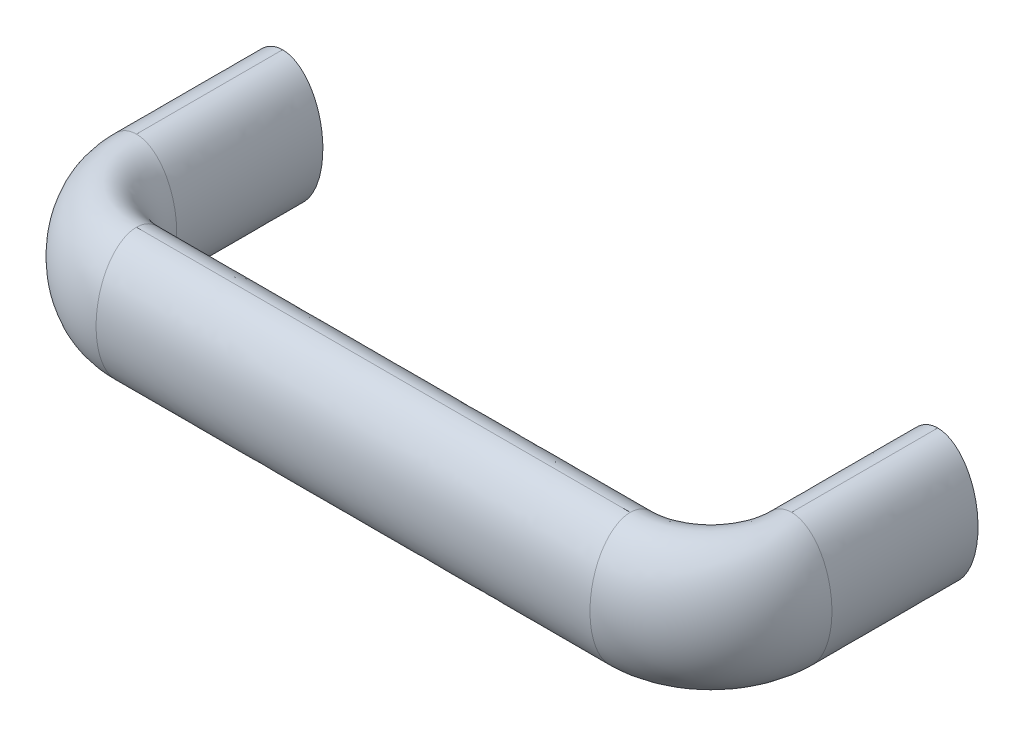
ISO-10303-21;
HEADER;
FILE_DESCRIPTION(('STEP AP214'),'2;1');
FILE_NAME('part.step','',(''),(''),'','','');
FILE_SCHEMA(('AUTOMOTIVE_DESIGN { 1 0 10303 214 1 1 1 1 }'));
ENDSEC;
DATA;
#1=APPLICATION_CONTEXT('core data for automotive mechanical design processes');
#2=APPLICATION_PROTOCOL_DEFINITION('international standard','automotive_design',2000,#1);
#3=PRODUCT_CONTEXT('',#1,'mechanical');
#4=PRODUCT('Part','Part','',(#3));
#5=PRODUCT_RELATED_PRODUCT_CATEGORY('part','',(#4));
#6=PRODUCT_DEFINITION_FORMATION('','',#4);
#7=PRODUCT_DEFINITION_CONTEXT('part definition',#1,'design');
#8=PRODUCT_DEFINITION('design','',#6,#7);
#9=PRODUCT_DEFINITION_SHAPE('','',#8);
#10=(LENGTH_UNIT() NAMED_UNIT(*) SI_UNIT(.MILLI.,.METRE.));
#11=(NAMED_UNIT(*) PLANE_ANGLE_UNIT() SI_UNIT($,.RADIAN.));
#12=(NAMED_UNIT(*) SI_UNIT($,.STERADIAN.) SOLID_ANGLE_UNIT());
#13=UNCERTAINTY_MEASURE_WITH_UNIT(LENGTH_MEASURE(1.E-05),#10,'distance_accuracy_value','');
#14=(GEOMETRIC_REPRESENTATION_CONTEXT(3) GLOBAL_UNCERTAINTY_ASSIGNED_CONTEXT((#13)) GLOBAL_UNIT_ASSIGNED_CONTEXT((#10,
#11,#12)) REPRESENTATION_CONTEXT('',''));
#15=CARTESIAN_POINT('',(0.,0.,0.));
#16=DIRECTION('',(0.,0.,1.));
#17=DIRECTION('',(1.,0.,0.));
#18=AXIS2_PLACEMENT_3D('',#15,#16,#17);
#19=CARTESIAN_POINT('',(122.837666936,13.156,0.));
#20=DIRECTION('',(0.,0.,1.));
#21=DIRECTION('',(0.,-1.,0.));
#22=AXIS2_PLACEMENT_3D('',#19,#20,#21);
#23=PLANE('',#22);
#24=CARTESIAN_POINT('',(132.,0.,0.));
#25=DIRECTION('',(0.,0.,-1.));
#26=DIRECTION('',(-1.,0.,0.));
#27=AXIS2_PLACEMENT_3D('',#24,#25,#26);
#28=CIRCLE('',#27,4.);
#29=CARTESIAN_POINT('',(128.,0.,0.));
#30=VERTEX_POINT('',#29);
#31=EDGE_CURVE('E304',#30,#30,#28,.T.);
#32=ORIENTED_EDGE('',*,*,#31,.F.);
#33=EDGE_LOOP('',(#32));
#34=FACE_BOUND('',#33,.T.);
#35=CARTESIAN_POINT('',(131.,-13.,0.));
#36=CARTESIAN_POINT('',(130.925091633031,-13.0000017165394,0.));
#37=CARTESIAN_POINT('',(130.850193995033,-12.9982898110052,0.));
#38=CARTESIAN_POINT('',(130.700558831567,-12.9914593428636,0.));
#39=CARTESIAN_POINT('',(130.625821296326,-12.9863409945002,0.));
#40=CARTESIAN_POINT('',(130.402196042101,-12.965920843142,0.));
#41=CARTESIAN_POINT('',(130.253741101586,-12.9455538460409,0.));
#42=CARTESIAN_POINT('',(129.960500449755,-12.8920007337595,0.));
#43=CARTESIAN_POINT('',(129.815694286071,-12.8589249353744,0.));
#44=CARTESIAN_POINT('',(129.529385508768,-12.7806399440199,0.));
#45=CARTESIAN_POINT('',(129.387883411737,-12.7354288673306,0.));
#46=CARTESIAN_POINT('',(129.10946384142,-12.6339087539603,0.));
#47=CARTESIAN_POINT('',(128.972532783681,-12.5776368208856,0.));
#48=CARTESIAN_POINT('',(128.703322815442,-12.4548420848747,0.));
#49=CARTESIAN_POINT('',(128.571045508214,-12.3883157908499,0.));
#50=CARTESIAN_POINT('',(128.181439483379,-12.1745898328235,0.));
#51=CARTESIAN_POINT('',(127.931737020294,-12.0133935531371,0.));
#52=CARTESIAN_POINT('',(127.314834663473,-11.5583412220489,0.));
#53=CARTESIAN_POINT('',(126.964227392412,-11.2420043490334,0.));
#54=CARTESIAN_POINT('',(126.479129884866,-10.7298141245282,0.));
#55=CARTESIAN_POINT('',(126.324021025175,-10.5524941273,0.));
#56=CARTESIAN_POINT('',(126.026740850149,-10.1872557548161,0.));
#57=CARTESIAN_POINT('',(125.884569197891,-9.99933765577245,0.));
#58=CARTESIAN_POINT('',(125.53693992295,-9.5078143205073,0.));
#59=CARTESIAN_POINT('',(125.340265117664,-9.19799841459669,0.));
#60=CARTESIAN_POINT('',(124.97446429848,-8.5624748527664,0.));
#61=CARTESIAN_POINT('',(124.805353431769,-8.23675858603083,0.));
#62=CARTESIAN_POINT('',(124.492465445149,-7.57296277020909,0.));
#63=CARTESIAN_POINT('',(124.348719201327,-7.23486874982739,0.));
#64=CARTESIAN_POINT('',(124.085047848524,-6.54962643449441,0.));
#65=CARTESIAN_POINT('',(123.965121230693,-6.20247871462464,0.));
#66=CARTESIAN_POINT('',(123.695009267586,-5.33179848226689,0.));
#67=CARTESIAN_POINT('',(123.5582028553,-4.80408820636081,0.));
#68=CARTESIAN_POINT('',(123.330145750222,-3.73883710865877,0.));
#69=CARTESIAN_POINT('',(123.238916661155,-3.20129174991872,0.));
#70=CARTESIAN_POINT('',(123.099722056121,-2.11962506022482,0.));
#71=CARTESIAN_POINT('',(123.051839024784,-1.57549318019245,0.));
#72=CARTESIAN_POINT('',(122.998498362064,-0.485287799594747,0.));
#73=CARTESIAN_POINT('',(122.9930327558,0.0607853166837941,0.));
#74=CARTESIAN_POINT('',(123.02475009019,1.16476999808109,0.));
#75=CARTESIAN_POINT('',(123.062954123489,1.72265302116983,0.));
#76=CARTESIAN_POINT('',(123.184641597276,2.83365673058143,0.));
#77=CARTESIAN_POINT('',(123.268139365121,3.38677585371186,0.));
#78=CARTESIAN_POINT('',(123.482261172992,4.48227170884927,0.));
#79=CARTESIAN_POINT('',(123.612739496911,5.02467624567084,0.));
#80=CARTESIAN_POINT('',(123.846318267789,5.82690837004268,0.));
#81=CARTESIAN_POINT('',(123.930458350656,6.09234837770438,0.));
#82=CARTESIAN_POINT('',(124.111989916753,6.61872005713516,0.));
#83=CARTESIAN_POINT('',(124.20938257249,6.87965132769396,0.));
#84=CARTESIAN_POINT('',(124.419683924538,7.39985027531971,0.));
#85=CARTESIAN_POINT('',(124.532807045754,7.65903155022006,0.));
#86=CARTESIAN_POINT('',(124.774208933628,8.1701831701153,0.));
#87=CARTESIAN_POINT('',(124.902483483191,8.4221554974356,0.));
#88=CARTESIAN_POINT('',(125.175130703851,8.91718970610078,0.));
#89=CARTESIAN_POINT('',(125.319499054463,9.16025395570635,0.));
#90=CARTESIAN_POINT('',(125.625387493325,9.63534677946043,0.));
#91=CARTESIAN_POINT('',(125.78690432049,9.86737743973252,0.));
#92=CARTESIAN_POINT('',(126.092280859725,10.270252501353,0.));
#93=CARTESIAN_POINT('',(126.232698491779,10.4436937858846,0.));
#94=CARTESIAN_POINT('',(126.525341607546,10.7802107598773,0.));
#95=CARTESIAN_POINT('',(126.677567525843,10.9432860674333,0.));
#96=CARTESIAN_POINT('',(127.152541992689,11.4137131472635,0.));
#97=CARTESIAN_POINT('',(127.494192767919,11.7030892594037,0.));
#98=CARTESIAN_POINT('',(127.991966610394,12.0482947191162,0.));
#99=CARTESIAN_POINT('',(128.127086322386,12.1351736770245,0.));
#100=CARTESIAN_POINT('',(128.40344393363,12.2985211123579,0.));
#101=CARTESIAN_POINT('',(128.544678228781,12.3749956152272,0.));
#102=CARTESIAN_POINT('',(128.832542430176,12.5161596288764,0.));
#103=CARTESIAN_POINT('',(128.979159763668,12.5808747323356,0.));
#104=CARTESIAN_POINT('',(129.277406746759,12.6974983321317,0.));
#105=CARTESIAN_POINT('',(129.429035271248,12.7494096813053,0.));
#106=CARTESIAN_POINT('',(129.697338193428,12.8278959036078,0.));
#107=CARTESIAN_POINT('',(129.81311695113,12.8575573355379,0.));
#108=CARTESIAN_POINT('',(130.046445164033,12.9087393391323,0.));
#109=CARTESIAN_POINT('',(130.163994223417,12.9302617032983,0.));
#110=CARTESIAN_POINT('',(130.400931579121,12.9649462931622,0.));
#111=CARTESIAN_POINT('',(130.520326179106,12.9780655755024,0.));
#112=CARTESIAN_POINT('',(130.759810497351,12.995606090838,0.));
#113=CARTESIAN_POINT('',(130.879900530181,13.0000230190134,0.));
#114=CARTESIAN_POINT('',(131.,13.,0.));
#115=B_SPLINE_CURVE_WITH_KNOTS('',3,(#35,#36,#37,#38,#39,#40,#41,#42,#43,#44,#45,#46,#47,#48,
#49,#50,#51,#52,#53,#54,#55,#56,#57,#58,#59,#60,#61,#62,#63,#64,#65,#66,#67,#68,#69,#70,#71,#72,
#73,#74,#75,#76,#77,#78,#79,#80,#81,#82,#83,#84,#85,#86,#87,#88,#89,#90,#91,#92,#93,#94,#95,#96,
#97,#98,#99,#100,#101,#102,#103,#104,#105,#106,#107,#108,#109,#110,#111,#112,#113,#114),
.UNSPECIFIED.,.F.,.F.,(4,2,2,2,2,2,2,2,2,2,2,2,2,2,2,2,2,2,2,2,2,2,2,2,2,2,2,2,2,2,2,2,2,2,2,2,
2,2,2,4),(0.,0.224684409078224,0.4493546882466,0.898233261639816,1.34330036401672,
1.78843659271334,2.23210434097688,2.6759234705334,3.56483199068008,4.97311104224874,
5.67947886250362,6.38582828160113,7.48505277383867,8.58487930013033,9.68603553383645,
10.7871219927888,12.4202433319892,14.054138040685,15.6911354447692,17.3278250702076,
19.0035808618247,20.6798670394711,22.3509981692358,23.1860821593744,24.0212400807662,
24.8691644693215,25.7168534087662,26.5643153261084,27.4116163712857,28.0805260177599,
28.7494602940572,30.0842887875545,30.5658835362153,31.0471981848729,31.5274524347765,
32.0075995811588,32.3658861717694,32.7240938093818,33.0841177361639,33.4443197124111),.UNSPECIFIED.);
#116=CARTESIAN_POINT('',(131.,-13.,0.));
#117=VERTEX_POINT('',#116);
#118=CARTESIAN_POINT('',(131.,13.,0.));
#119=VERTEX_POINT('',#118);
#120=EDGE_CURVE('E55',#117,#119,#115,.T.);
#121=ORIENTED_EDGE('',*,*,#120,.T.);
#122=CARTESIAN_POINT('',(131.,13.,0.));
#123=CARTESIAN_POINT('',(131.074908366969,13.0000017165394,0.));
#124=CARTESIAN_POINT('',(131.149806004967,12.9982898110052,0.));
#125=CARTESIAN_POINT('',(131.299441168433,12.9914593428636,0.));
#126=CARTESIAN_POINT('',(131.374178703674,12.9863409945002,0.));
#127=CARTESIAN_POINT('',(131.597803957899,12.965920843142,0.));
#128=CARTESIAN_POINT('',(131.746258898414,12.9455538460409,0.));
#129=CARTESIAN_POINT('',(132.039499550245,12.8920007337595,0.));
#130=CARTESIAN_POINT('',(132.184305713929,12.8589249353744,0.));
#131=CARTESIAN_POINT('',(132.470614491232,12.7806399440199,0.));
#132=CARTESIAN_POINT('',(132.612116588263,12.7354288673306,0.));
#133=CARTESIAN_POINT('',(132.89053615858,12.6339087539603,0.));
#134=CARTESIAN_POINT('',(133.027467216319,12.5776368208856,0.));
#135=CARTESIAN_POINT('',(133.296677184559,12.4548420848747,0.));
#136=CARTESIAN_POINT('',(133.428954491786,12.3883157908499,0.));
#137=CARTESIAN_POINT('',(133.818560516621,12.1745898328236,0.));
#138=CARTESIAN_POINT('',(134.068262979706,12.0133935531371,0.));
#139=CARTESIAN_POINT('',(134.685165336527,11.5583412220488,0.));
#140=CARTESIAN_POINT('',(135.035772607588,11.2420043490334,0.));
#141=CARTESIAN_POINT('',(135.520870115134,10.7298141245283,0.));
#142=CARTESIAN_POINT('',(135.675978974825,10.5524941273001,0.));
#143=CARTESIAN_POINT('',(135.973259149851,10.1872557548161,0.));
#144=CARTESIAN_POINT('',(136.115430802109,9.99933765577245,0.));
#145=CARTESIAN_POINT('',(136.46306007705,9.50781432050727,0.));
#146=CARTESIAN_POINT('',(136.659734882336,9.19799841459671,0.));
#147=CARTESIAN_POINT('',(137.025535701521,8.56247485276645,0.));
#148=CARTESIAN_POINT('',(137.194646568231,8.23675858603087,0.));
#149=CARTESIAN_POINT('',(137.507534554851,7.57296277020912,0.));
#150=CARTESIAN_POINT('',(137.651280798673,7.23486874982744,0.));
#151=CARTESIAN_POINT('',(137.914952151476,6.54962643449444,0.));
#152=CARTESIAN_POINT('',(138.034878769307,6.20247871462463,0.));
#153=CARTESIAN_POINT('',(138.304990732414,5.33179848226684,0.));
#154=CARTESIAN_POINT('',(138.4417971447,4.80408820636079,0.));
#155=CARTESIAN_POINT('',(138.669854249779,3.73883710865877,0.));
#156=CARTESIAN_POINT('',(138.761083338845,3.20129174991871,0.));
#157=CARTESIAN_POINT('',(138.900277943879,2.11962506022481,0.));
#158=CARTESIAN_POINT('',(138.948160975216,1.57549318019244,0.));
#159=CARTESIAN_POINT('',(139.001501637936,0.485287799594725,0.));
#160=CARTESIAN_POINT('',(139.0069672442,-0.0607853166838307,0.));
#161=CARTESIAN_POINT('',(138.97524990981,-1.16476999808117,0.));
#162=CARTESIAN_POINT('',(138.937045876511,-1.72265302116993,0.));
#163=CARTESIAN_POINT('',(138.815358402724,-2.83365673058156,0.));
#164=CARTESIAN_POINT('',(138.731860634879,-3.38677585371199,0.));
#165=CARTESIAN_POINT('',(138.517738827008,-4.48227170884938,0.));
#166=CARTESIAN_POINT('',(138.38726050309,-5.02467624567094,0.));
#167=CARTESIAN_POINT('',(138.153681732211,-5.82690837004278,0.));
#168=CARTESIAN_POINT('',(138.069541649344,-6.09234837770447,0.));
#169=CARTESIAN_POINT('',(137.888010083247,-6.61872005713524,0.));
#170=CARTESIAN_POINT('',(137.79061742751,-6.87965132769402,0.));
#171=CARTESIAN_POINT('',(137.580316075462,-7.39985027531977,0.));
#172=CARTESIAN_POINT('',(137.467192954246,-7.65903155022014,0.));
#173=CARTESIAN_POINT('',(137.225791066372,-8.17018317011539,0.));
#174=CARTESIAN_POINT('',(137.097516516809,-8.42215549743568,0.));
#175=CARTESIAN_POINT('',(136.824869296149,-8.91718970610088,0.));
#176=CARTESIAN_POINT('',(136.680500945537,-9.16025395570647,0.));
#177=CARTESIAN_POINT('',(136.374612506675,-9.63534677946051,0.));
#178=CARTESIAN_POINT('',(136.21309567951,-9.86737743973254,0.));
#179=CARTESIAN_POINT('',(135.907719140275,-10.270252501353,0.));
#180=CARTESIAN_POINT('',(135.767301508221,-10.4436937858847,0.));
#181=CARTESIAN_POINT('',(135.474658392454,-10.7802107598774,0.));
#182=CARTESIAN_POINT('',(135.322432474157,-10.9432860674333,0.));
#183=CARTESIAN_POINT('',(134.847458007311,-11.4137131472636,0.));
#184=CARTESIAN_POINT('',(134.505807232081,-11.7030892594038,0.));
#185=CARTESIAN_POINT('',(134.008033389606,-12.0482947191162,0.));
#186=CARTESIAN_POINT('',(133.872913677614,-12.1351736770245,0.));
#187=CARTESIAN_POINT('',(133.59655606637,-12.2985211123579,0.));
#188=CARTESIAN_POINT('',(133.455321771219,-12.3749956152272,0.));
#189=CARTESIAN_POINT('',(133.167457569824,-12.5161596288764,0.));
#190=CARTESIAN_POINT('',(133.020840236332,-12.5808747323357,0.));
#191=CARTESIAN_POINT('',(132.722593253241,-12.6974983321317,0.));
#192=CARTESIAN_POINT('',(132.570964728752,-12.7494096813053,0.));
#193=CARTESIAN_POINT('',(132.302661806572,-12.8278959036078,0.));
#194=CARTESIAN_POINT('',(132.18688304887,-12.8575573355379,0.));
#195=CARTESIAN_POINT('',(131.953554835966,-12.9087393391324,0.));
#196=CARTESIAN_POINT('',(131.836005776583,-12.9302617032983,0.));
#197=CARTESIAN_POINT('',(131.599068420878,-12.9649462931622,0.));
#198=CARTESIAN_POINT('',(131.479673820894,-12.9780655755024,0.));
#199=CARTESIAN_POINT('',(131.240189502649,-12.995606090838,0.));
#200=CARTESIAN_POINT('',(131.120099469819,-13.0000230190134,0.));
#201=CARTESIAN_POINT('',(131.,-13.,0.));
#202=B_SPLINE_CURVE_WITH_KNOTS('',3,(#122,#123,#124,#125,#126,#127,#128,#129,#130,#131,#132,
#133,#134,#135,#136,#137,#138,#139,#140,#141,#142,#143,#144,#145,#146,#147,#148,#149,#150,#151,
#152,#153,#154,#155,#156,#157,#158,#159,#160,#161,#162,#163,#164,#165,#166,#167,#168,#169,#170,
#171,#172,#173,#174,#175,#176,#177,#178,#179,#180,#181,#182,#183,#184,#185,#186,#187,#188,#189,
#190,#191,#192,#193,#194,#195,#196,#197,#198,#199,#200,#201),.UNSPECIFIED.,.F.,.F.,(4,2,2,2,2,2,
2,2,2,2,2,2,2,2,2,2,2,2,2,2,2,2,2,2,2,2,2,2,2,2,2,2,2,2,2,2,2,2,2,4),(0.,0.224684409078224,
0.4493546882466,0.898233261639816,1.34330036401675,1.78843659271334,2.2321043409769,
2.67592347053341,3.56483199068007,4.97311104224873,5.67947886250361,6.38582828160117,
7.4850527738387,8.58487930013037,9.6860355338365,10.7871219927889,12.4202433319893,
14.054138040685,15.6911354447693,17.3278250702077,19.0035808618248,20.6798670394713,
22.3509981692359,23.1860821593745,24.0212400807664,24.8691644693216,25.7168534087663,
26.5643153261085,27.4116163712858,28.0805260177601,28.7494602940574,30.0842887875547,
30.5658835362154,31.0471981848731,31.5274524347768,32.0075995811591,32.3658861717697,
32.724093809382,33.0841177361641,33.4443197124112),.UNSPECIFIED.);
#203=EDGE_CURVE('E19',#119,#117,#202,.T.);
#204=ORIENTED_EDGE('',*,*,#203,.T.);
#205=EDGE_LOOP('',(#121,#204));
#206=FACE_BOUND('',#205,.T.);
#207=ADVANCED_FACE('F14',(#34,#206),#23,.F.);
#208=CARTESIAN_POINT('',(131.,-13.,29.));
#209=CARTESIAN_POINT('',(131.,-13.,19.333333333));
#210=CARTESIAN_POINT('',(131.,-13.,9.666666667));
#211=CARTESIAN_POINT('',(131.,-13.,0.));
#212=CARTESIAN_POINT('',(147.,-13.,29.));
#213=CARTESIAN_POINT('',(147.,-13.,19.333333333));
#214=CARTESIAN_POINT('',(147.,-13.,9.666666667));
#215=CARTESIAN_POINT('',(147.,-13.,0.));
#216=CARTESIAN_POINT('',(147.,13.,29.));
#217=CARTESIAN_POINT('',(147.,13.,19.333333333));
#218=CARTESIAN_POINT('',(147.,13.,9.666666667));
#219=CARTESIAN_POINT('',(147.,13.,0.));
#220=CARTESIAN_POINT('',(131.,13.,29.));
#221=CARTESIAN_POINT('',(131.,13.,19.333333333));
#222=CARTESIAN_POINT('',(131.,13.,9.666666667));
#223=CARTESIAN_POINT('',(131.,13.,0.));
#224=(BOUNDED_SURFACE() B_SPLINE_SURFACE(3,3,((#208,#209,#210,#211),(#212,#213,#214,#215),(#216,
#217,#218,#219),(#220,#221,#222,#223)),.UNSPECIFIED.,.F.,.F.,
.F.) B_SPLINE_SURFACE_WITH_KNOTS((4,4),(4,4),(0.,1.),(0.,1.),
.UNSPECIFIED.) GEOMETRIC_REPRESENTATION_ITEM() RATIONAL_B_SPLINE_SURFACE(((1.,1.,1.,1.),
(0.333333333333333,0.333333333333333,0.333333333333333,0.333333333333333),(0.333333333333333,
0.333333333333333,0.333333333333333,0.333333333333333),(1.,1.,1.,1.))) REPRESENTATION_ITEM('') SURFACE());
#225=CARTESIAN_POINT('',(131.,-13.,29.));
#226=CARTESIAN_POINT('',(147.,-13.,29.));
#227=CARTESIAN_POINT('',(147.,13.,29.));
#228=CARTESIAN_POINT('',(131.,13.,29.));
#229=CARTESIAN_POINT('',(115.,13.,29.));
#230=CARTESIAN_POINT('',(115.,-13.,29.));
#231=CARTESIAN_POINT('',(131.,-13.,29.));
#232=(BOUNDED_CURVE() B_SPLINE_CURVE(3,(#225,#226,#227,#228,#229,#230,#231),.UNSPECIFIED.,.T.,
.F.) B_SPLINE_CURVE_WITH_KNOTS((4,3,4),(0.,0.5,1.),
.UNSPECIFIED.) CURVE() GEOMETRIC_REPRESENTATION_ITEM() RATIONAL_B_SPLINE_CURVE((1.,
0.333333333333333,0.333333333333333,1.,0.333333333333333,0.333333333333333,1.)) REPRESENTATION_ITEM(''));
#233=CARTESIAN_POINT('',(131.,-13.,29.));
#234=VERTEX_POINT('',#233);
#235=CARTESIAN_POINT('',(131.,13.,29.));
#236=VERTEX_POINT('',#235);
#237=EDGE_CURVE('E66',#234,#236,#232,.T.);
#238=DIRECTION('',(0.,0.,-1.));
#239=VECTOR('',#238,1.);
#240=CARTESIAN_POINT('',(131.,-13.,14.5));
#241=LINE('',#240,#239);
#242=EDGE_CURVE('E56',#234,#117,#241,.T.);
#243=DIRECTION('',(0.,0.,1.));
#244=VECTOR('',#243,1.);
#245=CARTESIAN_POINT('',(131.,13.,14.5));
#246=LINE('',#245,#244);
#247=EDGE_CURVE('E62',#119,#236,#246,.T.);
#248=ORIENTED_EDGE('',*,*,#237,.F.);
#249=ORIENTED_EDGE('',*,*,#242,.T.);
#250=ORIENTED_EDGE('',*,*,#203,.F.);
#251=ORIENTED_EDGE('',*,*,#247,.T.);
#252=EDGE_LOOP('',(#248,#249,#250,#251));
#253=FACE_BOUND('',#252,.T.);
#254=ADVANCED_FACE('F64',(#253),#224,.F.);
#255=CARTESIAN_POINT('',(131.,13.,29.));
#256=CARTESIAN_POINT('',(131.,13.,19.333333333));
#257=CARTESIAN_POINT('',(131.,13.,9.666666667));
#258=CARTESIAN_POINT('',(131.,13.,0.));
#259=CARTESIAN_POINT('',(115.,13.,29.));
#260=CARTESIAN_POINT('',(115.,13.,19.333333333));
#261=CARTESIAN_POINT('',(115.,13.,9.666666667));
#262=CARTESIAN_POINT('',(115.,13.,0.));
#263=CARTESIAN_POINT('',(115.,-13.,29.));
#264=CARTESIAN_POINT('',(115.,-13.,19.333333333));
#265=CARTESIAN_POINT('',(115.,-13.,9.666666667));
#266=CARTESIAN_POINT('',(115.,-13.,0.));
#267=CARTESIAN_POINT('',(131.,-13.,29.));
#268=CARTESIAN_POINT('',(131.,-13.,19.333333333));
#269=CARTESIAN_POINT('',(131.,-13.,9.666666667));
#270=CARTESIAN_POINT('',(131.,-13.,0.));
#271=(BOUNDED_SURFACE() B_SPLINE_SURFACE(3,3,((#255,#256,#257,#258),(#259,#260,#261,#262),(#263,
#264,#265,#266),(#267,#268,#269,#270)),.UNSPECIFIED.,.F.,.F.,
.F.) B_SPLINE_SURFACE_WITH_KNOTS((4,4),(4,4),(0.,1.),(0.,1.),
.UNSPECIFIED.) GEOMETRIC_REPRESENTATION_ITEM() RATIONAL_B_SPLINE_SURFACE(((1.,1.,1.,1.),
(0.333333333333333,0.333333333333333,0.333333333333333,0.333333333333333),(0.333333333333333,
0.333333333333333,0.333333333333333,0.333333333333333),(1.,1.,1.,1.))) REPRESENTATION_ITEM('') SURFACE());
#272=CARTESIAN_POINT('',(131.,-13.,29.));
#273=CARTESIAN_POINT('',(147.,-13.,29.));
#274=CARTESIAN_POINT('',(147.,13.,29.));
#275=CARTESIAN_POINT('',(131.,13.,29.));
#276=CARTESIAN_POINT('',(115.,13.,29.));
#277=CARTESIAN_POINT('',(115.,-13.,29.));
#278=CARTESIAN_POINT('',(131.,-13.,29.));
#279=(BOUNDED_CURVE() B_SPLINE_CURVE(3,(#272,#273,#274,#275,#276,#277,#278),.UNSPECIFIED.,.T.,
.F.) B_SPLINE_CURVE_WITH_KNOTS((4,3,4),(0.,0.5,1.),
.UNSPECIFIED.) CURVE() GEOMETRIC_REPRESENTATION_ITEM() RATIONAL_B_SPLINE_CURVE((1.,
0.333333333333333,0.333333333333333,1.,0.333333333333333,0.333333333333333,1.)) REPRESENTATION_ITEM(''));
#280=EDGE_CURVE('E127',#236,#234,#279,.T.);
#281=ORIENTED_EDGE('',*,*,#247,.F.);
#282=ORIENTED_EDGE('',*,*,#120,.F.);
#283=ORIENTED_EDGE('',*,*,#242,.F.);
#284=ORIENTED_EDGE('',*,*,#280,.F.);
#285=EDGE_LOOP('',(#281,#282,#283,#284));
#286=FACE_BOUND('',#285,.T.);
#287=ADVANCED_FACE('F59',(#286),#271,.F.);
#288=CARTESIAN_POINT('',(131.,-13.,29.));
#289=CARTESIAN_POINT('',(131.,-13.,38.372583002));
#290=CARTESIAN_POINT('',(124.372583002,-13.,45.));
#291=CARTESIAN_POINT('',(115.,-13.,45.));
#292=CARTESIAN_POINT('',(147.,-13.,29.));
#293=CARTESIAN_POINT('',(147.,-13.,47.745166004));
#294=CARTESIAN_POINT('',(133.745166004,-13.,61.));
#295=CARTESIAN_POINT('',(115.,-13.,61.));
#296=CARTESIAN_POINT('',(147.,13.,29.));
#297=CARTESIAN_POINT('',(147.,13.,47.745166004));
#298=CARTESIAN_POINT('',(133.745166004,13.,61.));
#299=CARTESIAN_POINT('',(115.,13.,61.));
#300=CARTESIAN_POINT('',(131.,13.,29.));
#301=CARTESIAN_POINT('',(131.,13.,38.372583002));
#302=CARTESIAN_POINT('',(124.372583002,13.,45.));
#303=CARTESIAN_POINT('',(115.,13.,45.));
#304=CARTESIAN_POINT('',(115.,13.,29.));
#305=CARTESIAN_POINT('',(115.,13.,29.));
#306=CARTESIAN_POINT('',(115.,13.,29.));
#307=CARTESIAN_POINT('',(115.,13.,29.));
#308=CARTESIAN_POINT('',(115.,-13.,29.));
#309=CARTESIAN_POINT('',(115.,-13.,29.));
#310=CARTESIAN_POINT('',(115.,-13.,29.));
#311=CARTESIAN_POINT('',(115.,-13.,29.));
#312=CARTESIAN_POINT('',(131.,-13.,29.));
#313=CARTESIAN_POINT('',(131.,-13.,38.372583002));
#314=CARTESIAN_POINT('',(124.372583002,-13.,45.));
#315=CARTESIAN_POINT('',(115.,-13.,45.));
#316=(BOUNDED_SURFACE() B_SPLINE_SURFACE(3,3,((#288,#289,#290,#291),(#292,#293,#294,#295),(#296,
#297,#298,#299),(#300,#301,#302,#303),(#304,#305,#306,#307),(#308,#309,#310,#311),(#312,#313,
#314,#315)),.UNSPECIFIED.,.T.,.F.,.F.) B_SPLINE_SURFACE_WITH_KNOTS((4,3,4),(4,4),(0.,0.5,1.),
(0.,1.),.UNSPECIFIED.) GEOMETRIC_REPRESENTATION_ITEM() RATIONAL_B_SPLINE_SURFACE(((1.,
0.804737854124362,0.804737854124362,1.),(0.333333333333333,0.268245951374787,0.268245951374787,
0.333333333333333),(0.333333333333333,0.268245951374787,0.268245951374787,0.333333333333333),
(1.,0.804737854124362,0.804737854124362,1.),(0.333333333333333,0.268245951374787,
0.268245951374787,0.333333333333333),(0.333333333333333,0.268245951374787,0.268245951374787,
0.333333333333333),(1.,0.804737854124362,0.804737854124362,1.))) REPRESENTATION_ITEM('') SURFACE());
#317=CARTESIAN_POINT('',(115.,-13.,45.));
#318=CARTESIAN_POINT('',(115.,-13.,61.));
#319=CARTESIAN_POINT('',(115.,13.,61.));
#320=CARTESIAN_POINT('',(115.,13.,45.));
#321=(BOUNDED_CURVE() B_SPLINE_CURVE(3,(#317,#318,#319,#320),.UNSPECIFIED.,.F.,
.F.) B_SPLINE_CURVE_WITH_KNOTS((4,4),(0.,1.),
.UNSPECIFIED.) CURVE() GEOMETRIC_REPRESENTATION_ITEM() RATIONAL_B_SPLINE_CURVE((1.,
0.333333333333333,0.333333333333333,1.)) REPRESENTATION_ITEM(''));
#322=CARTESIAN_POINT('',(115.,-13.,45.));
#323=VERTEX_POINT('',#322);
#324=CARTESIAN_POINT('',(115.,13.,45.));
#325=VERTEX_POINT('',#324);
#326=EDGE_CURVE('E144',#323,#325,#321,.T.);
#327=CARTESIAN_POINT('',(115.,13.,45.));
#328=CARTESIAN_POINT('',(115.,13.,29.));
#329=CARTESIAN_POINT('',(115.,-13.,29.));
#330=CARTESIAN_POINT('',(115.,-13.,45.));
#331=(BOUNDED_CURVE() B_SPLINE_CURVE(3,(#327,#328,#329,#330),.UNSPECIFIED.,.F.,
.F.) B_SPLINE_CURVE_WITH_KNOTS((4,4),(0.,1.),
.UNSPECIFIED.) CURVE() GEOMETRIC_REPRESENTATION_ITEM() RATIONAL_B_SPLINE_CURVE((1.,
0.333333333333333,0.333333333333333,1.)) REPRESENTATION_ITEM(''));
#332=EDGE_CURVE('E152',#325,#323,#331,.T.);
#333=ORIENTED_EDGE('',*,*,#280,.T.);
#334=ORIENTED_EDGE('',*,*,#237,.T.);
#335=EDGE_LOOP('',(#333,#334));
#336=FACE_BOUND('',#335,.T.);
#337=ORIENTED_EDGE('',*,*,#326,.F.);
#338=ORIENTED_EDGE('',*,*,#332,.F.);
#339=EDGE_LOOP('',(#337,#338));
#340=FACE_BOUND('',#339,.T.);
#341=ADVANCED_FACE('F81',(#336,#340),#316,.T.);
#342=CARTESIAN_POINT('',(115.,-13.,45.));
#343=CARTESIAN_POINT('',(82.333333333,-13.,45.));
#344=CARTESIAN_POINT('',(49.666666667,-13.,45.));
#345=CARTESIAN_POINT('',(17.,-13.,45.));
#346=CARTESIAN_POINT('',(115.,-13.,61.));
#347=CARTESIAN_POINT('',(82.3333333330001,-13.,61.));
#348=CARTESIAN_POINT('',(49.666666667,-13.,61.));
#349=CARTESIAN_POINT('',(17.,-13.,61.));
#350=CARTESIAN_POINT('',(115.,13.,61.));
#351=CARTESIAN_POINT('',(82.3333333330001,13.,61.));
#352=CARTESIAN_POINT('',(49.666666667,13.,61.));
#353=CARTESIAN_POINT('',(17.,13.,61.));
#354=CARTESIAN_POINT('',(115.,13.,45.));
#355=CARTESIAN_POINT('',(82.333333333,13.,45.));
#356=CARTESIAN_POINT('',(49.666666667,13.,45.));
#357=CARTESIAN_POINT('',(17.,13.,45.));
#358=(BOUNDED_SURFACE() B_SPLINE_SURFACE(3,3,((#342,#343,#344,#345),(#346,#347,#348,#349),(#350,
#351,#352,#353),(#354,#355,#356,#357)),.UNSPECIFIED.,.F.,.F.,
.F.) B_SPLINE_SURFACE_WITH_KNOTS((4,4),(4,4),(0.,1.),(0.,1.),
.UNSPECIFIED.) GEOMETRIC_REPRESENTATION_ITEM() RATIONAL_B_SPLINE_SURFACE(((1.,1.,1.,1.),
(0.333333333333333,0.333333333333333,0.333333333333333,0.333333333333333),(0.333333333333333,
0.333333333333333,0.333333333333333,0.333333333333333),(1.,1.,1.,1.))) REPRESENTATION_ITEM('') SURFACE());
#359=CARTESIAN_POINT('',(17.,-13.,45.));
#360=CARTESIAN_POINT('',(17.,-13.,61.));
#361=CARTESIAN_POINT('',(17.,13.,61.));
#362=CARTESIAN_POINT('',(17.,13.,45.));
#363=CARTESIAN_POINT('',(17.,13.,29.));
#364=CARTESIAN_POINT('',(17.,-13.,29.));
#365=CARTESIAN_POINT('',(17.,-13.,45.));
#366=(BOUNDED_CURVE() B_SPLINE_CURVE(3,(#359,#360,#361,#362,#363,#364,#365),.UNSPECIFIED.,.T.,
.F.) B_SPLINE_CURVE_WITH_KNOTS((4,3,4),(0.,0.5,1.),
.UNSPECIFIED.) CURVE() GEOMETRIC_REPRESENTATION_ITEM() RATIONAL_B_SPLINE_CURVE((1.,
0.333333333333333,0.333333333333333,1.,0.333333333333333,0.333333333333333,1.)) REPRESENTATION_ITEM(''));
#367=CARTESIAN_POINT('',(17.,-13.,45.));
#368=VERTEX_POINT('',#367);
#369=CARTESIAN_POINT('',(17.,13.,45.));
#370=VERTEX_POINT('',#369);
#371=EDGE_CURVE('E171',#368,#370,#366,.T.);
#372=DIRECTION('',(-1.,0.,0.));
#373=VECTOR('',#372,1.);
#374=CARTESIAN_POINT('',(66.,-13.,45.));
#375=LINE('',#374,#373);
#376=EDGE_CURVE('E158',#323,#368,#375,.T.);
#377=DIRECTION('',(1.,0.,0.));
#378=VECTOR('',#377,1.);
#379=CARTESIAN_POINT('',(66.,13.,45.));
#380=LINE('',#379,#378);
#381=EDGE_CURVE('E146',#370,#325,#380,.T.);
#382=ORIENTED_EDGE('',*,*,#371,.F.);
#383=ORIENTED_EDGE('',*,*,#376,.F.);
#384=ORIENTED_EDGE('',*,*,#326,.T.);
#385=ORIENTED_EDGE('',*,*,#381,.F.);
#386=EDGE_LOOP('',(#382,#383,#384,#385));
#387=FACE_BOUND('',#386,.T.);
#388=ADVANCED_FACE('F93',(#387),#358,.T.);
#389=CARTESIAN_POINT('',(115.,13.,45.));
#390=CARTESIAN_POINT('',(82.333333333,13.,45.));
#391=CARTESIAN_POINT('',(49.666666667,13.,45.));
#392=CARTESIAN_POINT('',(17.,13.,45.));
#393=CARTESIAN_POINT('',(115.,13.,29.));
#394=CARTESIAN_POINT('',(82.3333333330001,13.,29.));
#395=CARTESIAN_POINT('',(49.666666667,13.,29.));
#396=CARTESIAN_POINT('',(17.,13.,29.));
#397=CARTESIAN_POINT('',(115.,-13.,29.));
#398=CARTESIAN_POINT('',(82.3333333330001,-13.,29.));
#399=CARTESIAN_POINT('',(49.666666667,-13.,29.));
#400=CARTESIAN_POINT('',(17.,-13.,29.));
#401=CARTESIAN_POINT('',(115.,-13.,45.));
#402=CARTESIAN_POINT('',(82.333333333,-13.,45.));
#403=CARTESIAN_POINT('',(49.666666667,-13.,45.));
#404=CARTESIAN_POINT('',(17.,-13.,45.));
#405=(BOUNDED_SURFACE() B_SPLINE_SURFACE(3,3,((#389,#390,#391,#392),(#393,#394,#395,#396),(#397,
#398,#399,#400),(#401,#402,#403,#404)),.UNSPECIFIED.,.F.,.F.,
.F.) B_SPLINE_SURFACE_WITH_KNOTS((4,4),(4,4),(0.,1.),(0.,1.),
.UNSPECIFIED.) GEOMETRIC_REPRESENTATION_ITEM() RATIONAL_B_SPLINE_SURFACE(((1.,1.,1.,1.),
(0.333333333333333,0.333333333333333,0.333333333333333,0.333333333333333),(0.333333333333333,
0.333333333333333,0.333333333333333,0.333333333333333),(1.,1.,1.,1.))) REPRESENTATION_ITEM('') SURFACE());
#406=CARTESIAN_POINT('',(17.,-13.,45.));
#407=CARTESIAN_POINT('',(17.,-13.,61.));
#408=CARTESIAN_POINT('',(17.,13.,61.));
#409=CARTESIAN_POINT('',(17.,13.,45.));
#410=CARTESIAN_POINT('',(17.,13.,29.));
#411=CARTESIAN_POINT('',(17.,-13.,29.));
#412=CARTESIAN_POINT('',(17.,-13.,45.));
#413=(BOUNDED_CURVE() B_SPLINE_CURVE(3,(#406,#407,#408,#409,#410,#411,#412),.UNSPECIFIED.,.T.,
.F.) B_SPLINE_CURVE_WITH_KNOTS((4,3,4),(0.,0.5,1.),
.UNSPECIFIED.) CURVE() GEOMETRIC_REPRESENTATION_ITEM() RATIONAL_B_SPLINE_CURVE((1.,
0.333333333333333,0.333333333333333,1.,0.333333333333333,0.333333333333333,1.)) REPRESENTATION_ITEM(''));
#414=EDGE_CURVE('E224',#370,#368,#413,.T.);
#415=ORIENTED_EDGE('',*,*,#376,.T.);
#416=ORIENTED_EDGE('',*,*,#414,.F.);
#417=ORIENTED_EDGE('',*,*,#381,.T.);
#418=ORIENTED_EDGE('',*,*,#332,.T.);
#419=EDGE_LOOP('',(#415,#416,#417,#418));
#420=FACE_BOUND('',#419,.T.);
#421=ADVANCED_FACE('F189',(#420),#405,.T.);
#422=CARTESIAN_POINT('',(17.,-13.,45.));
#423=CARTESIAN_POINT('',(7.62741699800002,-13.,45.));
#424=CARTESIAN_POINT('',(1.00000000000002,-13.,38.372583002));
#425=CARTESIAN_POINT('',(1.00000000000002,-13.,29.));
#426=CARTESIAN_POINT('',(17.,-13.,61.));
#427=CARTESIAN_POINT('',(-1.74516600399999,-13.,61.));
#428=CARTESIAN_POINT('',(-15.,-13.,47.745166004));
#429=CARTESIAN_POINT('',(-15.,-13.,29.));
#430=CARTESIAN_POINT('',(17.,13.,61.));
#431=CARTESIAN_POINT('',(-1.74516600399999,13.,61.));
#432=CARTESIAN_POINT('',(-15.,13.,47.745166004));
#433=CARTESIAN_POINT('',(-15.,13.,29.));
#434=CARTESIAN_POINT('',(17.,13.,45.));
#435=CARTESIAN_POINT('',(7.62741699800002,13.,45.));
#436=CARTESIAN_POINT('',(1.00000000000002,13.,38.372583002));
#437=CARTESIAN_POINT('',(1.00000000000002,13.,29.));
#438=CARTESIAN_POINT('',(17.,13.,29.));
#439=CARTESIAN_POINT('',(17.,13.,29.));
#440=CARTESIAN_POINT('',(17.,13.,29.));
#441=CARTESIAN_POINT('',(17.,13.,29.));
#442=CARTESIAN_POINT('',(17.,-13.,29.));
#443=CARTESIAN_POINT('',(17.,-13.,29.));
#444=CARTESIAN_POINT('',(17.,-13.,29.));
#445=CARTESIAN_POINT('',(17.,-13.,29.));
#446=CARTESIAN_POINT('',(17.,-13.,45.));
#447=CARTESIAN_POINT('',(7.62741699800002,-13.,45.));
#448=CARTESIAN_POINT('',(1.00000000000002,-13.,38.372583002));
#449=CARTESIAN_POINT('',(1.00000000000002,-13.,29.));
#450=(BOUNDED_SURFACE() B_SPLINE_SURFACE(3,3,((#422,#423,#424,#425),(#426,#427,#428,#429),(#430,
#431,#432,#433),(#434,#435,#436,#437),(#438,#439,#440,#441),(#442,#443,#444,#445),(#446,#447,
#448,#449)),.UNSPECIFIED.,.T.,.F.,.F.) B_SPLINE_SURFACE_WITH_KNOTS((4,3,4),(4,4),(0.,0.5,1.),
(0.,1.),.UNSPECIFIED.) GEOMETRIC_REPRESENTATION_ITEM() RATIONAL_B_SPLINE_SURFACE(((1.,
0.804737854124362,0.804737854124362,1.),(0.333333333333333,0.268245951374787,0.268245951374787,
0.333333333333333),(0.333333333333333,0.268245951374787,0.268245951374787,0.333333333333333),
(1.,0.804737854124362,0.804737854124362,1.),(0.333333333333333,0.268245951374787,
0.268245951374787,0.333333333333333),(0.333333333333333,0.268245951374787,0.268245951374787,
0.333333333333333),(1.,0.804737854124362,0.804737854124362,1.))) REPRESENTATION_ITEM('') SURFACE());
#451=CARTESIAN_POINT('',(1.00000000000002,-13.,29.));
#452=CARTESIAN_POINT('',(-15.,-13.,29.));
#453=CARTESIAN_POINT('',(-15.,13.,29.));
#454=CARTESIAN_POINT('',(1.00000000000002,13.,29.));
#455=(BOUNDED_CURVE() B_SPLINE_CURVE(3,(#451,#452,#453,#454),.UNSPECIFIED.,.F.,
.F.) B_SPLINE_CURVE_WITH_KNOTS((4,4),(0.,1.),
.UNSPECIFIED.) CURVE() GEOMETRIC_REPRESENTATION_ITEM() RATIONAL_B_SPLINE_CURVE((1.,
0.333333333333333,0.333333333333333,1.)) REPRESENTATION_ITEM(''));
#456=CARTESIAN_POINT('',(1.00000000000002,-13.,29.));
#457=VERTEX_POINT('',#456);
#458=CARTESIAN_POINT('',(1.00000000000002,13.,29.));
#459=VERTEX_POINT('',#458);
#460=EDGE_CURVE('E242',#457,#459,#455,.T.);
#461=CARTESIAN_POINT('',(1.00000000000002,13.,29.));
#462=CARTESIAN_POINT('',(17.,13.,29.));
#463=CARTESIAN_POINT('',(17.,-13.,29.));
#464=CARTESIAN_POINT('',(1.00000000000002,-13.,29.));
#465=(BOUNDED_CURVE() B_SPLINE_CURVE(3,(#461,#462,#463,#464),.UNSPECIFIED.,.F.,
.F.) B_SPLINE_CURVE_WITH_KNOTS((4,4),(0.,1.),
.UNSPECIFIED.) CURVE() GEOMETRIC_REPRESENTATION_ITEM() RATIONAL_B_SPLINE_CURVE((1.,
0.333333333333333,0.333333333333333,1.)) REPRESENTATION_ITEM(''));
#466=EDGE_CURVE('E249',#459,#457,#465,.T.);
#467=ORIENTED_EDGE('',*,*,#414,.T.);
#468=ORIENTED_EDGE('',*,*,#371,.T.);
#469=EDGE_LOOP('',(#467,#468));
#470=FACE_BOUND('',#469,.T.);
#471=ORIENTED_EDGE('',*,*,#460,.F.);
#472=ORIENTED_EDGE('',*,*,#466,.F.);
#473=EDGE_LOOP('',(#471,#472));
#474=FACE_BOUND('',#473,.T.);
#475=ADVANCED_FACE('F177',(#470,#474),#450,.T.);
#476=CARTESIAN_POINT('',(1.00000000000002,-13.,29.));
#477=CARTESIAN_POINT('',(1.00000000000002,-13.,19.333333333));
#478=CARTESIAN_POINT('',(1.00000000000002,-13.,9.666666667));
#479=CARTESIAN_POINT('',(1.00000000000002,-13.,0.));
#480=CARTESIAN_POINT('',(-15.,-13.,29.));
#481=CARTESIAN_POINT('',(-15.,-13.,19.333333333));
#482=CARTESIAN_POINT('',(-15.,-13.,9.666666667));
#483=CARTESIAN_POINT('',(-15.,-13.,0.));
#484=CARTESIAN_POINT('',(-15.,13.,29.));
#485=CARTESIAN_POINT('',(-15.,13.,19.333333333));
#486=CARTESIAN_POINT('',(-15.,13.,9.666666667));
#487=CARTESIAN_POINT('',(-15.,13.,0.));
#488=CARTESIAN_POINT('',(1.00000000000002,13.,29.));
#489=CARTESIAN_POINT('',(1.00000000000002,13.,19.333333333));
#490=CARTESIAN_POINT('',(1.00000000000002,13.,9.666666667));
#491=CARTESIAN_POINT('',(1.00000000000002,13.,0.));
#492=(BOUNDED_SURFACE() B_SPLINE_SURFACE(3,3,((#476,#477,#478,#479),(#480,#481,#482,#483),(#484,
#485,#486,#487),(#488,#489,#490,#491)),.UNSPECIFIED.,.F.,.F.,
.F.) B_SPLINE_SURFACE_WITH_KNOTS((4,4),(4,4),(0.,1.),(0.,1.),
.UNSPECIFIED.) GEOMETRIC_REPRESENTATION_ITEM() RATIONAL_B_SPLINE_SURFACE(((1.,1.,1.,1.),
(0.333333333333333,0.333333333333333,0.333333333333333,0.333333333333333),(0.333333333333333,
0.333333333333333,0.333333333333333,0.333333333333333),(1.,1.,1.,1.))) REPRESENTATION_ITEM('') SURFACE());
#493=CARTESIAN_POINT('',(1.00000000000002,-13.,0.));
#494=CARTESIAN_POINT('',(0.925091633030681,-13.0000017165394,0.));
#495=CARTESIAN_POINT('',(0.850193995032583,-12.9982898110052,0.));
#496=CARTESIAN_POINT('',(0.700558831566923,-12.9914593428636,0.));
#497=CARTESIAN_POINT('',(0.625821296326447,-12.9863409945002,0.));
#498=CARTESIAN_POINT('',(0.402196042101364,-12.965920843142,0.));
#499=CARTESIAN_POINT('',(0.253741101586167,-12.9455538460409,0.));
#500=CARTESIAN_POINT('',(-0.0394995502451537,-12.8920007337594,0.));
#501=CARTESIAN_POINT('',(-0.184305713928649,-12.8589249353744,0.));
#502=CARTESIAN_POINT('',(-0.470614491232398,-12.7806399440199,0.));
#503=CARTESIAN_POINT('',(-0.612116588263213,-12.7354288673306,0.));
#504=CARTESIAN_POINT('',(-0.890536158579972,-12.6339087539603,0.));
#505=CARTESIAN_POINT('',(-1.02746721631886,-12.5776368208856,0.));
#506=CARTESIAN_POINT('',(-1.2966771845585,-12.4548420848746,0.));
#507=CARTESIAN_POINT('',(-1.42895449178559,-12.3883157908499,0.));
#508=CARTESIAN_POINT('',(-1.81856051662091,-12.1745898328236,0.));
#509=CARTESIAN_POINT('',(-2.06826297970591,-12.0133935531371,0.));
#510=CARTESIAN_POINT('',(-2.68516533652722,-11.5583412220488,0.));
#511=CARTESIAN_POINT('',(-3.03577260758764,-11.2420043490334,0.));
#512=CARTESIAN_POINT('',(-3.5208701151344,-10.7298141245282,0.));
#513=CARTESIAN_POINT('',(-3.67597897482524,-10.5524941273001,0.));
#514=CARTESIAN_POINT('',(-3.97325914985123,-10.1872557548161,0.));
#515=CARTESIAN_POINT('',(-4.11543080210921,-9.99933765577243,0.));
#516=CARTESIAN_POINT('',(-4.46306007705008,-9.50781432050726,0.));
#517=CARTESIAN_POINT('',(-4.65973488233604,-9.19799841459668,0.));
#518=CARTESIAN_POINT('',(-5.02553570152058,-8.56247485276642,0.));
#519=CARTESIAN_POINT('',(-5.19464656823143,-8.23675858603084,0.));
#520=CARTESIAN_POINT('',(-5.50753455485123,-7.5729627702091,0.));
#521=CARTESIAN_POINT('',(-5.65128079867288,-7.2348687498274,0.));
#522=CARTESIAN_POINT('',(-5.91495215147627,-6.5496264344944,0.));
#523=CARTESIAN_POINT('',(-6.03487876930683,-6.20247871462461,0.));
#524=CARTESIAN_POINT('',(-6.3049907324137,-5.33179848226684,0.));
#525=CARTESIAN_POINT('',(-6.44179714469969,-4.80408820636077,0.));
#526=CARTESIAN_POINT('',(-6.6698542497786,-3.73883710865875,0.));
#527=CARTESIAN_POINT('',(-6.7610833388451,-3.2012917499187,0.));
#528=CARTESIAN_POINT('',(-6.90027794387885,-2.11962506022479,0.));
#529=CARTESIAN_POINT('',(-6.94816097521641,-1.57549318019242,0.));
#530=CARTESIAN_POINT('',(-7.00150163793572,-0.48528779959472,0.));
#531=CARTESIAN_POINT('',(-7.00696724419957,0.0607853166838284,0.));
#532=CARTESIAN_POINT('',(-6.97524990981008,1.16476999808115,0.));
#533=CARTESIAN_POINT('',(-6.93704587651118,1.7226530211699,0.));
#534=CARTESIAN_POINT('',(-6.81535840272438,2.83365673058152,0.));
#535=CARTESIAN_POINT('',(-6.73186063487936,3.38677585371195,0.));
#536=CARTESIAN_POINT('',(-6.51773882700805,4.48227170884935,0.));
#537=CARTESIAN_POINT('',(-6.38726050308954,5.02467624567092,0.));
#538=CARTESIAN_POINT('',(-6.15368173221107,5.82690837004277,0.));
#539=CARTESIAN_POINT('',(-6.0695416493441,6.09234837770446,0.));
#540=CARTESIAN_POINT('',(-5.88801008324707,6.61872005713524,0.));
#541=CARTESIAN_POINT('',(-5.7906174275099,6.87965132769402,0.));
#542=CARTESIAN_POINT('',(-5.58031607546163,7.39985027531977,0.));
#543=CARTESIAN_POINT('',(-5.46719295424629,7.65903155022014,0.));
#544=CARTESIAN_POINT('',(-5.22579106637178,8.17018317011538,0.));
#545=CARTESIAN_POINT('',(-5.09751651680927,8.42215549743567,0.));
#546=CARTESIAN_POINT('',(-4.82486929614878,8.91718970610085,0.));
#547=CARTESIAN_POINT('',(-4.68050094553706,9.16025395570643,0.));
#548=CARTESIAN_POINT('',(-4.37461250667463,9.63534677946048,0.));
#549=CARTESIAN_POINT('',(-4.21309567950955,9.86737743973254,0.));
#550=CARTESIAN_POINT('',(-3.90771914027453,10.270252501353,0.));
#551=CARTESIAN_POINT('',(-3.76730150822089,10.4436937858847,0.));
#552=CARTESIAN_POINT('',(-3.47465839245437,10.7802107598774,0.));
#553=CARTESIAN_POINT('',(-3.32243247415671,10.9432860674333,0.));
#554=CARTESIAN_POINT('',(-2.84745800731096,11.4137131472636,0.));
#555=CARTESIAN_POINT('',(-2.50580723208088,11.7030892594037,0.));
#556=CARTESIAN_POINT('',(-2.008033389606,12.0482947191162,0.));
#557=CARTESIAN_POINT('',(-1.87291367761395,12.1351736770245,0.));
#558=CARTESIAN_POINT('',(-1.59655606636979,12.2985211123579,0.));
#559=CARTESIAN_POINT('',(-1.45532177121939,12.3749956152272,0.));
#560=CARTESIAN_POINT('',(-1.16745756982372,12.5161596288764,0.));
#561=CARTESIAN_POINT('',(-1.02084023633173,12.5808747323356,0.));
#562=CARTESIAN_POINT('',(-0.722593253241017,12.6974983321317,0.));
#563=CARTESIAN_POINT('',(-0.570964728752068,12.7494096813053,0.));
#564=CARTESIAN_POINT('',(-0.302661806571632,12.8278959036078,0.));
#565=CARTESIAN_POINT('',(-0.186883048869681,12.8575573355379,0.));
#566=CARTESIAN_POINT('',(0.0464451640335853,12.9087393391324,0.));
#567=CARTESIAN_POINT('',(0.163994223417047,12.9302617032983,0.));
#568=CARTESIAN_POINT('',(0.400931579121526,12.9649462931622,0.));
#569=CARTESIAN_POINT('',(0.520326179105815,12.9780655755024,0.));
#570=CARTESIAN_POINT('',(0.759810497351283,12.995606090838,0.));
#571=CARTESIAN_POINT('',(0.879900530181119,13.0000230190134,0.));
#572=CARTESIAN_POINT('',(1.00000000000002,13.,0.));
#573=B_SPLINE_CURVE_WITH_KNOTS('',3,(#493,#494,#495,#496,#497,#498,#499,#500,#501,#502,#503,
#504,#505,#506,#507,#508,#509,#510,#511,#512,#513,#514,#515,#516,#517,#518,#519,#520,#521,#522,
#523,#524,#525,#526,#527,#528,#529,#530,#531,#532,#533,#534,#535,#536,#537,#538,#539,#540,#541,
#542,#543,#544,#545,#546,#547,#548,#549,#550,#551,#552,#553,#554,#555,#556,#557,#558,#559,#560,
#561,#562,#563,#564,#565,#566,#567,#568,#569,#570,#571,#572),.UNSPECIFIED.,.F.,.F.,(4,2,2,2,2,2,
2,2,2,2,2,2,2,2,2,2,2,2,2,2,2,2,2,2,2,2,2,2,2,2,2,2,2,2,2,2,2,2,2,4),(0.,0.224684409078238,
0.449354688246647,0.898233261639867,1.34330036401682,1.78843659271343,2.23210434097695,
2.67592347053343,3.56483199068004,4.97311104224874,5.67947886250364,6.38582828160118,
7.48505277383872,8.58487930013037,9.68603553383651,10.7871219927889,12.4202433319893,
14.054138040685,15.6911354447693,17.3278250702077,19.0035808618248,20.6798670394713,
22.3509981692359,23.1860821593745,24.0212400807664,24.8691644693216,25.7168534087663,
26.5643153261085,27.4116163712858,28.08052601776,28.7494602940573,30.0842887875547,
30.5658835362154,31.0471981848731,31.5274524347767,32.007599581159,32.3658861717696,
32.7240938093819,33.084117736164,33.4443197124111),.UNSPECIFIED.);
#574=CARTESIAN_POINT('',(1.00000000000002,-13.,0.));
#575=VERTEX_POINT('',#574);
#576=CARTESIAN_POINT('',(1.00000000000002,13.,0.));
#577=VERTEX_POINT('',#576);
#578=EDGE_CURVE('E30',#575,#577,#573,.T.);
#579=DIRECTION('',(0.,0.,-1.));
#580=VECTOR('',#579,1.);
#581=CARTESIAN_POINT('',(1.00000000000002,-13.,14.5));
#582=LINE('',#581,#580);
#583=EDGE_CURVE('E255',#457,#575,#582,.T.);
#584=DIRECTION('',(0.,0.,1.));
#585=VECTOR('',#584,1.);
#586=CARTESIAN_POINT('',(1.00000000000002,13.,14.5));
#587=LINE('',#586,#585);
#588=EDGE_CURVE('E244',#577,#459,#587,.T.);
#589=ORIENTED_EDGE('',*,*,#578,.F.);
#590=ORIENTED_EDGE('',*,*,#583,.F.);
#591=ORIENTED_EDGE('',*,*,#460,.T.);
#592=ORIENTED_EDGE('',*,*,#588,.F.);
#593=EDGE_LOOP('',(#589,#590,#591,#592));
#594=FACE_BOUND('',#593,.T.);
#595=ADVANCED_FACE('F188',(#594),#492,.T.);
#596=CARTESIAN_POINT('',(1.00000000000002,13.,29.));
#597=CARTESIAN_POINT('',(1.00000000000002,13.,19.333333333));
#598=CARTESIAN_POINT('',(1.00000000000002,13.,9.666666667));
#599=CARTESIAN_POINT('',(1.00000000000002,13.,0.));
#600=CARTESIAN_POINT('',(17.,13.,29.));
#601=CARTESIAN_POINT('',(17.,13.,19.333333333));
#602=CARTESIAN_POINT('',(17.,13.,9.666666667));
#603=CARTESIAN_POINT('',(17.,13.,0.));
#604=CARTESIAN_POINT('',(17.,-13.,29.));
#605=CARTESIAN_POINT('',(17.,-13.,19.333333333));
#606=CARTESIAN_POINT('',(17.,-13.,9.666666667));
#607=CARTESIAN_POINT('',(17.,-13.,0.));
#608=CARTESIAN_POINT('',(1.00000000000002,-13.,29.));
#609=CARTESIAN_POINT('',(1.00000000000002,-13.,19.333333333));
#610=CARTESIAN_POINT('',(1.00000000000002,-13.,9.666666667));
#611=CARTESIAN_POINT('',(1.00000000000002,-13.,0.));
#612=(BOUNDED_SURFACE() B_SPLINE_SURFACE(3,3,((#596,#597,#598,#599),(#600,#601,#602,#603),(#604,
#605,#606,#607),(#608,#609,#610,#611)),.UNSPECIFIED.,.F.,.F.,
.F.) B_SPLINE_SURFACE_WITH_KNOTS((4,4),(4,4),(0.,1.),(0.,1.),
.UNSPECIFIED.) GEOMETRIC_REPRESENTATION_ITEM() RATIONAL_B_SPLINE_SURFACE(((1.,1.,1.,1.),
(0.333333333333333,0.333333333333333,0.333333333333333,0.333333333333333),(0.333333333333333,
0.333333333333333,0.333333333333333,0.333333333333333),(1.,1.,1.,1.))) REPRESENTATION_ITEM('') SURFACE());
#613=CARTESIAN_POINT('',(1.00000000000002,13.,0.));
#614=CARTESIAN_POINT('',(1.07490836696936,13.0000017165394,0.));
#615=CARTESIAN_POINT('',(1.14980600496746,12.9982898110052,0.));
#616=CARTESIAN_POINT('',(1.29944116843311,12.9914593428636,0.));
#617=CARTESIAN_POINT('',(1.37417870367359,12.9863409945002,0.));
#618=CARTESIAN_POINT('',(1.59780395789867,12.965920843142,0.));
#619=CARTESIAN_POINT('',(1.74625889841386,12.9455538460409,0.));
#620=CARTESIAN_POINT('',(2.03949955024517,12.8920007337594,0.));
#621=CARTESIAN_POINT('',(2.18430571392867,12.8589249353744,0.));
#622=CARTESIAN_POINT('',(2.47061449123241,12.7806399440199,0.));
#623=CARTESIAN_POINT('',(2.61211658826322,12.7354288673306,0.));
#624=CARTESIAN_POINT('',(2.89053615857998,12.6339087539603,0.));
#625=CARTESIAN_POINT('',(3.02746721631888,12.5776368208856,0.));
#626=CARTESIAN_POINT('',(3.29667718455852,12.4548420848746,0.));
#627=CARTESIAN_POINT('',(3.42895449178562,12.3883157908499,0.));
#628=CARTESIAN_POINT('',(3.81856051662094,12.1745898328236,0.));
#629=CARTESIAN_POINT('',(4.06826297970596,12.0133935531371,0.));
#630=CARTESIAN_POINT('',(4.68516533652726,11.5583412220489,0.));
#631=CARTESIAN_POINT('',(5.03577260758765,11.2420043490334,0.));
#632=CARTESIAN_POINT('',(5.52087011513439,10.7298141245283,0.));
#633=CARTESIAN_POINT('',(5.67597897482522,10.5524941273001,0.));
#634=CARTESIAN_POINT('',(5.97325914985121,10.1872557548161,0.));
#635=CARTESIAN_POINT('',(6.11543080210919,9.9993376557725,0.));
#636=CARTESIAN_POINT('',(6.46306007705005,9.50781432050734,0.));
#637=CARTESIAN_POINT('',(6.65973488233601,9.19799841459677,0.));
#638=CARTESIAN_POINT('',(7.02553570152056,8.56247485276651,0.));
#639=CARTESIAN_POINT('',(7.19464656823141,8.23675858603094,0.));
#640=CARTESIAN_POINT('',(7.50753455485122,7.5729627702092,0.));
#641=CARTESIAN_POINT('',(7.65128079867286,7.23486874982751,0.));
#642=CARTESIAN_POINT('',(7.91495215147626,6.54962643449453,0.));
#643=CARTESIAN_POINT('',(8.03487876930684,6.20247871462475,0.));
#644=CARTESIAN_POINT('',(8.30499073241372,5.33179848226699,0.));
#645=CARTESIAN_POINT('',(8.44179714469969,4.80408820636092,0.));
#646=CARTESIAN_POINT('',(8.66985424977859,3.7388371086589,0.));
#647=CARTESIAN_POINT('',(8.7610833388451,3.20129174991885,0.));
#648=CARTESIAN_POINT('',(8.90027794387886,2.11962506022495,0.));
#649=CARTESIAN_POINT('',(8.94816097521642,1.57549318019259,0.));
#650=CARTESIAN_POINT('',(9.00150163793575,0.48528779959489,0.));
#651=CARTESIAN_POINT('',(9.00696724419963,-0.0607853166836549,0.));
#652=CARTESIAN_POINT('',(8.97524990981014,-1.16476999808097,0.));
#653=CARTESIAN_POINT('',(8.93704587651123,-1.72265302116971,0.));
#654=CARTESIAN_POINT('',(8.81535840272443,-2.83365673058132,0.));
#655=CARTESIAN_POINT('',(8.73186063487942,-3.38677585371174,0.));
#656=CARTESIAN_POINT('',(8.51773882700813,-4.48227170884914,0.));
#657=CARTESIAN_POINT('',(8.38726050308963,-5.02467624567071,0.));
#658=CARTESIAN_POINT('',(8.15368173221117,-5.82690837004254,0.));
#659=CARTESIAN_POINT('',(8.0695416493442,-6.09234837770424,0.));
#660=CARTESIAN_POINT('',(7.88801008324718,-6.61872005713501,0.));
#661=CARTESIAN_POINT('',(7.79061742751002,-6.87965132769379,0.));
#662=CARTESIAN_POINT('',(7.58031607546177,-7.39985027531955,0.));
#663=CARTESIAN_POINT('',(7.46719295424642,-7.65903155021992,0.));
#664=CARTESIAN_POINT('',(7.22579106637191,-8.17018317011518,0.));
#665=CARTESIAN_POINT('',(7.0975165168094,-8.42215549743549,0.));
#666=CARTESIAN_POINT('',(6.82486929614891,-8.91718970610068,0.));
#667=CARTESIAN_POINT('',(6.68050094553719,-9.16025395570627,0.));
#668=CARTESIAN_POINT('',(6.37461250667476,-9.63534677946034,0.));
#669=CARTESIAN_POINT('',(6.21309567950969,-9.86737743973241,0.));
#670=CARTESIAN_POINT('',(5.90771914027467,-10.2702525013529,0.));
#671=CARTESIAN_POINT('',(5.76730150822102,-10.4436937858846,0.));
#672=CARTESIAN_POINT('',(5.47465839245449,-10.7802107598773,0.));
#673=CARTESIAN_POINT('',(5.32243247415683,-10.9432860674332,0.));
#674=CARTESIAN_POINT('',(4.84745800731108,-11.4137131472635,0.));
#675=CARTESIAN_POINT('',(4.50580723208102,-11.7030892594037,0.));
#676=CARTESIAN_POINT('',(4.00803338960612,-12.0482947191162,0.));
#677=CARTESIAN_POINT('',(3.87291367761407,-12.1351736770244,0.));
#678=CARTESIAN_POINT('',(3.59655606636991,-12.2985211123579,0.));
#679=CARTESIAN_POINT('',(3.4553217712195,-12.3749956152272,0.));
#680=CARTESIAN_POINT('',(3.16745756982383,-12.5161596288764,0.));
#681=CARTESIAN_POINT('',(3.02084023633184,-12.5808747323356,0.));
#682=CARTESIAN_POINT('',(2.72259325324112,-12.6974983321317,0.));
#683=CARTESIAN_POINT('',(2.57096472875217,-12.7494096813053,0.));
#684=CARTESIAN_POINT('',(2.30266180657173,-12.8278959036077,0.));
#685=CARTESIAN_POINT('',(2.18688304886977,-12.8575573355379,0.));
#686=CARTESIAN_POINT('',(1.95355483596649,-12.9087393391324,0.));
#687=CARTESIAN_POINT('',(1.83600577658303,-12.9302617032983,0.));
#688=CARTESIAN_POINT('',(1.59906842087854,-12.9649462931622,0.));
#689=CARTESIAN_POINT('',(1.47967382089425,-12.9780655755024,0.));
#690=CARTESIAN_POINT('',(1.24018950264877,-12.995606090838,0.));
#691=CARTESIAN_POINT('',(1.12009946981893,-13.0000230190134,0.));
#692=CARTESIAN_POINT('',(1.00000000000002,-13.,0.));
#693=B_SPLINE_CURVE_WITH_KNOTS('',3,(#613,#614,#615,#616,#617,#618,#619,#620,#621,#622,#623,
#624,#625,#626,#627,#628,#629,#630,#631,#632,#633,#634,#635,#636,#637,#638,#639,#640,#641,#642,
#643,#644,#645,#646,#647,#648,#649,#650,#651,#652,#653,#654,#655,#656,#657,#658,#659,#660,#661,
#662,#663,#664,#665,#666,#667,#668,#669,#670,#671,#672,#673,#674,#675,#676,#677,#678,#679,#680,
#681,#682,#683,#684,#685,#686,#687,#688,#689,#690,#691,#692),.UNSPECIFIED.,.F.,.F.,(4,2,2,2,2,2,
2,2,2,2,2,2,2,2,2,2,2,2,2,2,2,2,2,2,2,2,2,2,2,2,2,2,2,2,2,2,2,2,2,4),(0.,0.224684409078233,
0.449354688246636,0.898233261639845,1.34330036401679,1.7884365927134,2.23210434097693,
2.67592347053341,3.56483199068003,4.97311104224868,5.67947886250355,6.38582828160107,
7.4850527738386,8.58487930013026,9.68603553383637,10.7871219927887,12.4202433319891,
14.0541380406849,15.6911354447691,17.3278250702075,19.0035808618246,20.679867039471,
22.3509981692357,23.1860821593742,24.0212400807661,24.8691644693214,25.7168534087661,
26.5643153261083,27.4116163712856,28.0805260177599,28.7494602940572,30.0842887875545,
30.5658835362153,31.047198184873,31.5274524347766,32.0075995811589,32.3658861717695,
32.7240938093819,33.084117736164,33.4443197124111),.UNSPECIFIED.);
#694=EDGE_CURVE('E9',#577,#575,#693,.T.);
#695=ORIENTED_EDGE('',*,*,#583,.T.);
#696=ORIENTED_EDGE('',*,*,#694,.F.);
#697=ORIENTED_EDGE('',*,*,#588,.T.);
#698=ORIENTED_EDGE('',*,*,#466,.T.);
#699=EDGE_LOOP('',(#695,#696,#697,#698));
#700=FACE_BOUND('',#699,.T.);
#701=ADVANCED_FACE('F265',(#700),#612,.T.);
#702=CARTESIAN_POINT('',(9.16233306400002,13.156,0.));
#703=DIRECTION('',(0.,0.,-1.));
#704=DIRECTION('',(0.,-1.,0.));
#705=AXIS2_PLACEMENT_3D('',#702,#703,#704);
#706=PLANE('',#705);
#707=CARTESIAN_POINT('',(0.,0.,0.));
#708=DIRECTION('',(0.,0.,-1.));
#709=DIRECTION('',(-1.,0.,0.));
#710=AXIS2_PLACEMENT_3D('',#707,#708,#709);
#711=CIRCLE('',#710,4.);
#712=CARTESIAN_POINT('',(-4.,0.,0.));
#713=VERTEX_POINT('',#712);
#714=EDGE_CURVE('E298',#713,#713,#711,.T.);
#715=ORIENTED_EDGE('',*,*,#714,.F.);
#716=EDGE_LOOP('',(#715));
#717=FACE_BOUND('',#716,.T.);
#718=ORIENTED_EDGE('',*,*,#578,.T.);
#719=ORIENTED_EDGE('',*,*,#694,.T.);
#720=EDGE_LOOP('',(#718,#719));
#721=FACE_BOUND('',#720,.T.);
#722=ADVANCED_FACE('F16',(#717,#721),#706,.T.);
#723=CARTESIAN_POINT('',(0.,0.,13.));
#724=DIRECTION('',(0.,0.,-1.));
#725=DIRECTION('',(-1.,0.,0.));
#726=AXIS2_PLACEMENT_3D('',#723,#724,#725);
#727=CYLINDRICAL_SURFACE('',#726,4.);
#728=CARTESIAN_POINT('',(0.,0.,13.));
#729=DIRECTION('',(0.,0.,-1.));
#730=DIRECTION('',(-1.,0.,0.));
#731=AXIS2_PLACEMENT_3D('',#728,#729,#730);
#732=CIRCLE('',#731,4.);
#733=CARTESIAN_POINT('',(-4.,0.,13.));
#734=VERTEX_POINT('',#733);
#735=EDGE_CURVE('E57',#734,#734,#732,.T.);
#736=ORIENTED_EDGE('',*,*,#735,.F.);
#737=EDGE_LOOP('',(#736));
#738=FACE_BOUND('',#737,.T.);
#739=ORIENTED_EDGE('',*,*,#714,.T.);
#740=EDGE_LOOP('',(#739));
#741=FACE_BOUND('',#740,.T.);
#742=ADVANCED_FACE('F320',(#738,#741),#727,.F.);
#743=CARTESIAN_POINT('',(0.,0.,13.));
#744=DIRECTION('',(0.,0.,-1.));
#745=DIRECTION('',(-1.,0.,0.));
#746=AXIS2_PLACEMENT_3D('',#743,#744,#745);
#747=PLANE('',#746);
#748=ORIENTED_EDGE('',*,*,#735,.T.);
#749=EDGE_LOOP('',(#748));
#750=FACE_BOUND('',#749,.T.);
#751=ADVANCED_FACE('F315',(#750),#747,.T.);
#752=CARTESIAN_POINT('',(132.,0.,13.));
#753=DIRECTION('',(0.,0.,-1.));
#754=DIRECTION('',(-1.,0.,0.));
#755=AXIS2_PLACEMENT_3D('',#752,#753,#754);
#756=CYLINDRICAL_SURFACE('',#755,4.);
#757=CARTESIAN_POINT('',(132.,0.,13.));
#758=DIRECTION('',(0.,0.,-1.));
#759=DIRECTION('',(-1.,0.,0.));
#760=AXIS2_PLACEMENT_3D('',#757,#758,#759);
#761=CIRCLE('',#760,4.);
#762=CARTESIAN_POINT('',(128.,0.,13.));
#763=VERTEX_POINT('',#762);
#764=EDGE_CURVE('E301',#763,#763,#761,.T.);
#765=ORIENTED_EDGE('',*,*,#764,.F.);
#766=EDGE_LOOP('',(#765));
#767=FACE_BOUND('',#766,.T.);
#768=ORIENTED_EDGE('',*,*,#31,.T.);
#769=EDGE_LOOP('',(#768));
#770=FACE_BOUND('',#769,.T.);
#771=ADVANCED_FACE('F312',(#767,#770),#756,.F.);
#772=CARTESIAN_POINT('',(132.,0.,13.));
#773=DIRECTION('',(0.,0.,-1.));
#774=DIRECTION('',(-1.,0.,0.));
#775=AXIS2_PLACEMENT_3D('',#772,#773,#774);
#776=PLANE('',#775);
#777=ORIENTED_EDGE('',*,*,#764,.T.);
#778=EDGE_LOOP('',(#777));
#779=FACE_BOUND('',#778,.T.);
#780=ADVANCED_FACE('F310',(#779),#776,.T.);
#781=CLOSED_SHELL('',(#207,#254,#287,#341,#388,#421,#475,#595,#701,#722,#742,#751,#771,#780));
#782=MANIFOLD_SOLID_BREP('B1',#781);
#783=ADVANCED_BREP_SHAPE_REPRESENTATION('',(#18,#782),#14);
#784=SHAPE_DEFINITION_REPRESENTATION(#9,#783);
ENDSEC;
END-ISO-10303-21;
